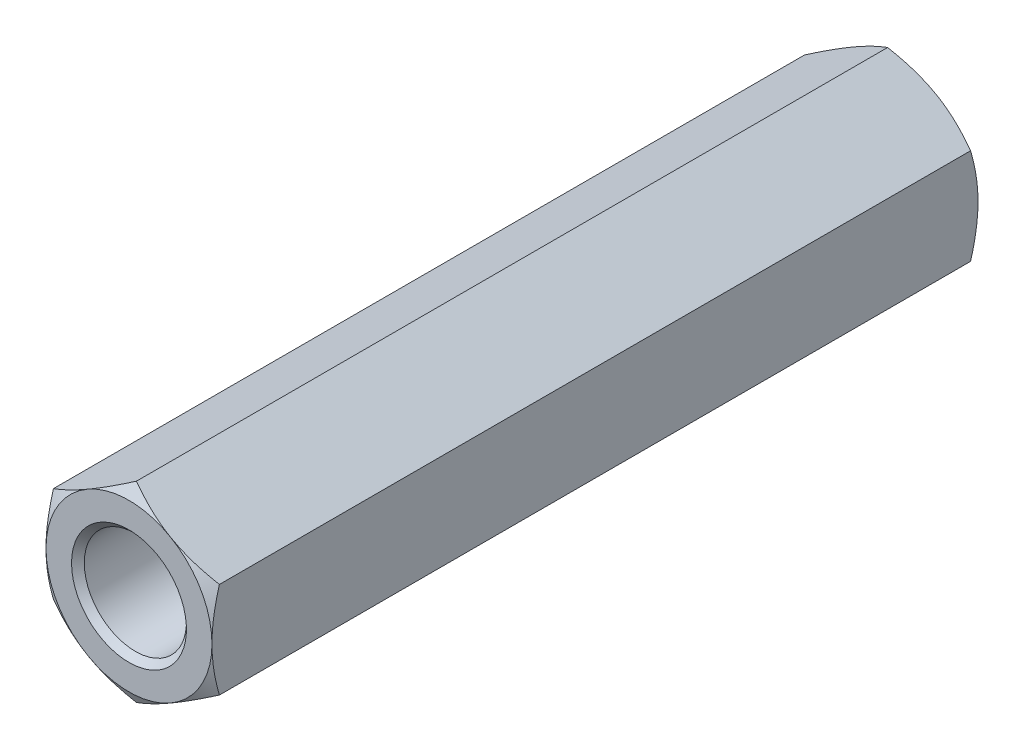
ISO-10303-21;
HEADER;
FILE_DESCRIPTION(('STEP AP214'),'2;1');
FILE_NAME('part.step','',(''),(''),'','','');
FILE_SCHEMA(('AUTOMOTIVE_DESIGN { 1 0 10303 214 1 1 1 1 }'));
ENDSEC;
DATA;
#1=APPLICATION_CONTEXT('core data for automotive mechanical design processes');
#2=APPLICATION_PROTOCOL_DEFINITION('international standard','automotive_design',2000,#1);
#3=PRODUCT_CONTEXT('',#1,'mechanical');
#4=PRODUCT('Part','Part','',(#3));
#5=PRODUCT_RELATED_PRODUCT_CATEGORY('part','',(#4));
#6=PRODUCT_DEFINITION_FORMATION('','',#4);
#7=PRODUCT_DEFINITION_CONTEXT('part definition',#1,'design');
#8=PRODUCT_DEFINITION('design','',#6,#7);
#9=PRODUCT_DEFINITION_SHAPE('','',#8);
#10=(LENGTH_UNIT() NAMED_UNIT(*) SI_UNIT(.MILLI.,.METRE.));
#11=(NAMED_UNIT(*) PLANE_ANGLE_UNIT() SI_UNIT($,.RADIAN.));
#12=(NAMED_UNIT(*) SI_UNIT($,.STERADIAN.) SOLID_ANGLE_UNIT());
#13=UNCERTAINTY_MEASURE_WITH_UNIT(LENGTH_MEASURE(1.E-05),#10,'distance_accuracy_value','');
#14=(GEOMETRIC_REPRESENTATION_CONTEXT(3) GLOBAL_UNCERTAINTY_ASSIGNED_CONTEXT((#13)) GLOBAL_UNIT_ASSIGNED_CONTEXT((#10,
#11,#12)) REPRESENTATION_CONTEXT('',''));
#15=CARTESIAN_POINT('',(0.,0.,0.));
#16=DIRECTION('',(0.,0.,1.));
#17=DIRECTION('',(1.,0.,0.));
#18=AXIS2_PLACEMENT_3D('',#15,#16,#17);
#19=CARTESIAN_POINT('',(6.5,3.75277674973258,60.));
#20=DIRECTION('',(-0.5,-0.866025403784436,0.));
#21=DIRECTION('',(-0.866025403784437,0.5,0.));
#22=AXIS2_PLACEMENT_3D('',#19,#20,#21);
#23=PLANE('',#22);
#24=CARTESIAN_POINT('',(-0.00019999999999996,7.50566896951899,0.580623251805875));
#25=CARTESIAN_POINT('',(0.14267745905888,7.42317863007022,0.533004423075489));
#26=CARTESIAN_POINT('',(0.286087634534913,7.3403807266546,0.487546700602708));
#27=CARTESIAN_POINT('',(0.574072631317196,7.17411251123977,0.401548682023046));
#28=CARTESIAN_POINT('',(0.718647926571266,7.09064192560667,0.361010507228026));
#29=CARTESIAN_POINT('',(1.15468865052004,6.8388936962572,0.247571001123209));
#30=CARTESIAN_POINT('',(1.44787528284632,6.66962231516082,0.183047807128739));
#31=CARTESIAN_POINT('',(1.88662374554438,6.41631077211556,0.10738658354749));
#32=CARTESIAN_POINT('',(2.03087463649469,6.33302748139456,0.0858328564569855));
#33=CARTESIAN_POINT('',(2.32002821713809,6.16608458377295,0.049690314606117));
#34=CARTESIAN_POINT('',(2.46493084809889,6.08242501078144,0.035100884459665));
#35=CARTESIAN_POINT('',(2.75498777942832,5.91496056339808,0.0132587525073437));
#36=CARTESIAN_POINT('',(2.90014160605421,5.83115596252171,0.00599772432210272));
#37=CARTESIAN_POINT('',(3.19057533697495,5.66347396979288,-0.00103969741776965));
#38=CARTESIAN_POINT('',(3.33585523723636,5.57959658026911,-0.000816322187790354));
#39=CARTESIAN_POINT('',(3.7338759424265,5.34979921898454,0.010083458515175));
#40=CARTESIAN_POINT('',(3.98648646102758,5.20395446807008,0.028381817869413));
#41=CARTESIAN_POINT('',(4.49002967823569,4.91323365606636,0.0864063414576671));
#42=CARTESIAN_POINT('',(4.74096060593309,4.76835861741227,0.126152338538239));
#43=CARTESIAN_POINT('',(5.24551722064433,4.47705272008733,0.225505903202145));
#44=CARTESIAN_POINT('',(5.49907924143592,4.33065861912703,0.285534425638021));
#45=CARTESIAN_POINT('',(6.00242193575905,4.04005357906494,0.421774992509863));
#46=CARTESIAN_POINT('',(6.25220905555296,3.89583891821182,0.497955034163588));
#47=CARTESIAN_POINT('',(6.5002,3.75266127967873,0.580623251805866));
#48=B_SPLINE_CURVE_WITH_KNOTS('',3,(#24,#25,#26,#27,#28,#29,#30,#31,#32,#33,#34,#35,#36,#37,#38,
#39,#40,#41,#42,#43,#44,#45,#46,#47),.UNSPECIFIED.,.F.,.F.,(4,2,2,2,2,2,2,2,2,2,2,4),(0.,
0.515105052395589,1.03043143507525,2.06322554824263,2.56697389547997,3.07067772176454,
3.57380860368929,4.07692394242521,4.95279354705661,5.82947446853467,6.72559912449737,
7.61996451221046),.UNSPECIFIED.);
#49=CARTESIAN_POINT('',(0.,7.50555349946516,0.580556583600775));
#50=VERTEX_POINT('',#49);
#51=CARTESIAN_POINT('',(3.25,5.62916512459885,0.));
#52=VERTEX_POINT('',#51);
#53=EDGE_CURVE('E330',#50,#52,#48,.T.);
#54=ORIENTED_EDGE('',*,*,#53,.F.);
#55=DIRECTION('',(0.,0.,-1.));
#56=VECTOR('',#55,1.);
#57=CARTESIAN_POINT('',(0.,7.50555349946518,60.));
#58=LINE('',#57,#56);
#59=CARTESIAN_POINT('',(0.,7.50555349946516,59.4194434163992));
#60=VERTEX_POINT('',#59);
#61=EDGE_CURVE('E239',#60,#50,#58,.T.);
#62=ORIENTED_EDGE('',*,*,#61,.F.);
#63=CARTESIAN_POINT('',(6.5002,3.75266127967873,59.4193767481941));
#64=CARTESIAN_POINT('',(6.35732254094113,3.83515161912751,59.4669955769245));
#65=CARTESIAN_POINT('',(6.2139123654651,3.91794952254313,59.5124532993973));
#66=CARTESIAN_POINT('',(5.92592736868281,4.08421773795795,59.598451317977));
#67=CARTESIAN_POINT('',(5.78135207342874,4.16768832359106,59.638989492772));
#68=CARTESIAN_POINT('',(5.34531134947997,4.41943655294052,59.7524289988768));
#69=CARTESIAN_POINT('',(5.05212471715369,4.5887079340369,59.8169521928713));
#70=CARTESIAN_POINT('',(4.61337625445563,4.84201947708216,59.8926134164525));
#71=CARTESIAN_POINT('',(4.46912536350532,4.92530276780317,59.914167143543));
#72=CARTESIAN_POINT('',(4.17997178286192,5.09224566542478,59.9503096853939));
#73=CARTESIAN_POINT('',(4.03506915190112,5.17590523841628,59.9648991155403));
#74=CARTESIAN_POINT('',(3.74501222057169,5.34336968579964,59.9867412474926));
#75=CARTESIAN_POINT('',(3.5998583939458,5.42717428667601,59.9940022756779));
#76=CARTESIAN_POINT('',(3.30942466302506,5.59485627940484,60.0010396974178));
#77=CARTESIAN_POINT('',(3.16414476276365,5.67873366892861,60.0008163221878));
#78=CARTESIAN_POINT('',(2.76612405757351,5.90853103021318,59.9899165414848));
#79=CARTESIAN_POINT('',(2.51351353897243,6.05437578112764,59.9716181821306));
#80=CARTESIAN_POINT('',(2.00997032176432,6.34509659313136,59.9135936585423));
#81=CARTESIAN_POINT('',(1.75903939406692,6.48997163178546,59.8738476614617));
#82=CARTESIAN_POINT('',(1.25448277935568,6.7812775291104,59.7744940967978));
#83=CARTESIAN_POINT('',(1.00092075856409,6.92767163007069,59.714465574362));
#84=CARTESIAN_POINT('',(0.497578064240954,7.21827667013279,59.5782250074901));
#85=CARTESIAN_POINT('',(0.247790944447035,7.36249133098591,59.5020449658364));
#86=CARTESIAN_POINT('',(-0.000200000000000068,7.50566896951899,59.4193767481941));
#87=B_SPLINE_CURVE_WITH_KNOTS('',3,(#63,#64,#65,#66,#67,#68,#69,#70,#71,#72,#73,#74,#75,#76,#77,
#78,#79,#80,#81,#82,#83,#84,#85,#86),.UNSPECIFIED.,.F.,.F.,(4,2,2,2,2,2,2,2,2,2,2,4),(0.,
0.515105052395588,1.03043143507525,2.06322554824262,2.56697389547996,3.07067772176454,
3.57380860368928,4.0769239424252,4.95279354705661,5.82947446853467,6.72559912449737,
7.61996451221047),.UNSPECIFIED.);
#88=CARTESIAN_POINT('',(3.25,5.62916512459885,60.));
#89=VERTEX_POINT('',#88);
#90=EDGE_CURVE('E225',#89,#60,#87,.T.);
#91=ORIENTED_EDGE('',*,*,#90,.F.);
#92=CARTESIAN_POINT('',(6.5,3.75277674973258,59.4194434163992));
#93=VERTEX_POINT('',#92);
#94=EDGE_CURVE('E301',#93,#89,#87,.T.);
#95=ORIENTED_EDGE('',*,*,#94,.F.);
#96=DIRECTION('',(0.,0.,-1.));
#97=VECTOR('',#96,1.);
#98=CARTESIAN_POINT('',(6.5,3.75277674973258,60.));
#99=LINE('',#98,#97);
#100=CARTESIAN_POINT('',(6.5,3.75277674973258,0.580556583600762));
#101=VERTEX_POINT('',#100);
#102=EDGE_CURVE('E227',#93,#101,#99,.T.);
#103=ORIENTED_EDGE('',*,*,#102,.T.);
#104=EDGE_CURVE('E37',#52,#101,#48,.T.);
#105=ORIENTED_EDGE('',*,*,#104,.F.);
#106=EDGE_LOOP('',(#54,#62,#91,#95,#103,#105));
#107=FACE_BOUND('',#106,.T.);
#108=ADVANCED_FACE('F14',(#107),#23,.F.);
#109=CARTESIAN_POINT('',(-6.5,3.75277674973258,60.));
#110=DIRECTION('',(-0.5,0.866025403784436,0.));
#111=DIRECTION('',(0.866025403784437,0.5,0.));
#112=AXIS2_PLACEMENT_3D('',#109,#110,#111);
#113=PLANE('',#112);
#114=ORIENTED_EDGE('',*,*,#61,.T.);
#115=CARTESIAN_POINT('',(0.000200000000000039,7.50566896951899,0.580623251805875));
#116=CARTESIAN_POINT('',(-0.14267745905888,7.42317863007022,0.533004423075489));
#117=CARTESIAN_POINT('',(-0.286087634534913,7.3403807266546,0.487546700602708));
#118=CARTESIAN_POINT('',(-0.574072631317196,7.17411251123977,0.401548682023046));
#119=CARTESIAN_POINT('',(-0.718647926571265,7.09064192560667,0.361010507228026));
#120=CARTESIAN_POINT('',(-1.15468865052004,6.8388936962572,0.247571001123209));
#121=CARTESIAN_POINT('',(-1.44787528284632,6.66962231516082,0.183047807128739));
#122=CARTESIAN_POINT('',(-1.88662374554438,6.41631077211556,0.10738658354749));
#123=CARTESIAN_POINT('',(-2.03087463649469,6.33302748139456,0.0858328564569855));
#124=CARTESIAN_POINT('',(-2.32002821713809,6.16608458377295,0.049690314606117));
#125=CARTESIAN_POINT('',(-2.46493084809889,6.08242501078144,0.035100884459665));
#126=CARTESIAN_POINT('',(-2.75498777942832,5.91496056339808,0.0132587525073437));
#127=CARTESIAN_POINT('',(-2.90014160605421,5.83115596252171,0.00599772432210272));
#128=CARTESIAN_POINT('',(-3.19057533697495,5.66347396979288,-0.00103969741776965));
#129=CARTESIAN_POINT('',(-3.33585523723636,5.57959658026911,-0.000816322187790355));
#130=CARTESIAN_POINT('',(-3.7338759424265,5.34979921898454,0.010083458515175));
#131=CARTESIAN_POINT('',(-3.98648646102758,5.20395446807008,0.028381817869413));
#132=CARTESIAN_POINT('',(-4.49002967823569,4.91323365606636,0.0864063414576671));
#133=CARTESIAN_POINT('',(-4.74096060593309,4.76835861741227,0.126152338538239));
#134=CARTESIAN_POINT('',(-5.24551722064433,4.47705272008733,0.225505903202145));
#135=CARTESIAN_POINT('',(-5.49907924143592,4.33065861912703,0.285534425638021));
#136=CARTESIAN_POINT('',(-6.00242193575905,4.04005357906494,0.421774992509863));
#137=CARTESIAN_POINT('',(-6.25220905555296,3.89583891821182,0.497955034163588));
#138=CARTESIAN_POINT('',(-6.5002,3.75266127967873,0.580623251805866));
#139=B_SPLINE_CURVE_WITH_KNOTS('',3,(#115,#116,#117,#118,#119,#120,#121,#122,#123,#124,#125,
#126,#127,#128,#129,#130,#131,#132,#133,#134,#135,#136,#137,#138),.UNSPECIFIED.,.F.,.F.,(4,2,2,
2,2,2,2,2,2,2,2,4),(0.,0.515105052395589,1.03043143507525,2.06322554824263,2.56697389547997,
3.07067772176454,3.57380860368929,4.07692394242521,4.95279354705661,5.82947446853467,
6.72559912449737,7.61996451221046),.UNSPECIFIED.);
#140=CARTESIAN_POINT('',(-3.25,5.62916512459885,0.));
#141=VERTEX_POINT('',#140);
#142=EDGE_CURVE('E184',#50,#141,#139,.T.);
#143=ORIENTED_EDGE('',*,*,#142,.T.);
#144=CARTESIAN_POINT('',(-6.5,3.75277674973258,0.580556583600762));
#145=VERTEX_POINT('',#144);
#146=EDGE_CURVE('E319',#141,#145,#139,.T.);
#147=ORIENTED_EDGE('',*,*,#146,.T.);
#148=DIRECTION('',(0.,0.,-1.));
#149=VECTOR('',#148,1.);
#150=CARTESIAN_POINT('',(-6.5,3.75277674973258,60.));
#151=LINE('',#150,#149);
#152=CARTESIAN_POINT('',(-6.5,3.75277674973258,59.4194434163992));
#153=VERTEX_POINT('',#152);
#154=EDGE_CURVE('E236',#153,#145,#151,.T.);
#155=ORIENTED_EDGE('',*,*,#154,.F.);
#156=CARTESIAN_POINT('',(-6.5002,3.75266127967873,59.4193767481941));
#157=CARTESIAN_POINT('',(-6.35732254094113,3.83515161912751,59.4669955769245));
#158=CARTESIAN_POINT('',(-6.2139123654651,3.91794952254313,59.5124532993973));
#159=CARTESIAN_POINT('',(-5.92592736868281,4.08421773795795,59.598451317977));
#160=CARTESIAN_POINT('',(-5.78135207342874,4.16768832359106,59.638989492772));
#161=CARTESIAN_POINT('',(-5.34531134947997,4.41943655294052,59.7524289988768));
#162=CARTESIAN_POINT('',(-5.05212471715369,4.5887079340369,59.8169521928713));
#163=CARTESIAN_POINT('',(-4.61337625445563,4.84201947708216,59.8926134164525));
#164=CARTESIAN_POINT('',(-4.46912536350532,4.92530276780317,59.914167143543));
#165=CARTESIAN_POINT('',(-4.17997178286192,5.09224566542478,59.9503096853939));
#166=CARTESIAN_POINT('',(-4.03506915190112,5.17590523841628,59.9648991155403));
#167=CARTESIAN_POINT('',(-3.74501222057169,5.34336968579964,59.9867412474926));
#168=CARTESIAN_POINT('',(-3.5998583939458,5.42717428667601,59.9940022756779));
#169=CARTESIAN_POINT('',(-3.30942466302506,5.59485627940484,60.0010396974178));
#170=CARTESIAN_POINT('',(-3.16414476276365,5.67873366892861,60.0008163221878));
#171=CARTESIAN_POINT('',(-2.76612405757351,5.90853103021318,59.9899165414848));
#172=CARTESIAN_POINT('',(-2.51351353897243,6.05437578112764,59.9716181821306));
#173=CARTESIAN_POINT('',(-2.00997032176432,6.34509659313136,59.9135936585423));
#174=CARTESIAN_POINT('',(-1.75903939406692,6.48997163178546,59.8738476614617));
#175=CARTESIAN_POINT('',(-1.25448277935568,6.7812775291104,59.7744940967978));
#176=CARTESIAN_POINT('',(-1.00092075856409,6.92767163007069,59.714465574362));
#177=CARTESIAN_POINT('',(-0.497578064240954,7.21827667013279,59.5782250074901));
#178=CARTESIAN_POINT('',(-0.247790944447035,7.36249133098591,59.5020449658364));
#179=CARTESIAN_POINT('',(0.000200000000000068,7.50566896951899,59.4193767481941));
#180=B_SPLINE_CURVE_WITH_KNOTS('',3,(#156,#157,#158,#159,#160,#161,#162,#163,#164,#165,#166,
#167,#168,#169,#170,#171,#172,#173,#174,#175,#176,#177,#178,#179),.UNSPECIFIED.,.F.,.F.,(4,2,2,
2,2,2,2,2,2,2,2,4),(0.,0.515105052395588,1.03043143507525,2.06322554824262,2.56697389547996,
3.07067772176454,3.57380860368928,4.0769239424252,4.95279354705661,5.82947446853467,
6.72559912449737,7.61996451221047),.UNSPECIFIED.);
#181=CARTESIAN_POINT('',(-3.25,5.62916512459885,60.));
#182=VERTEX_POINT('',#181);
#183=EDGE_CURVE('E218',#153,#182,#180,.T.);
#184=ORIENTED_EDGE('',*,*,#183,.T.);
#185=EDGE_CURVE('E226',#182,#60,#180,.T.);
#186=ORIENTED_EDGE('',*,*,#185,.T.);
#187=EDGE_LOOP('',(#114,#143,#147,#155,#184,#186));
#188=FACE_BOUND('',#187,.T.);
#189=ADVANCED_FACE('F197',(#188),#113,.T.);
#190=CARTESIAN_POINT('',(-6.5,3.75277674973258,60.));
#191=DIRECTION('',(1.,0.,0.));
#192=DIRECTION('',(0.,0.,-1.));
#193=AXIS2_PLACEMENT_3D('',#190,#191,#192);
#194=PLANE('',#193);
#195=CARTESIAN_POINT('',(-6.5,-10.0834180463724,3.17362971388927));
#196=CARTESIAN_POINT('',(-6.5,-9.79950109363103,3.03589247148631));
#197=CARTESIAN_POINT('',(-6.5,-9.51493272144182,2.89947501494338));
#198=CARTESIAN_POINT('',(-6.5,-8.94414675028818,2.63002186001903));
#199=CARTESIAN_POINT('',(-6.5,-8.65792890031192,2.49698669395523));
#200=CARTESIAN_POINT('',(-6.5,-8.08202429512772,2.23437163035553));
#201=CARTESIAN_POINT('',(-6.5,-7.79232713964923,2.10481446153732));
#202=CARTESIAN_POINT('',(-6.5,-7.21062978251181,1.85099781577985));
#203=CARTESIAN_POINT('',(-6.5,-6.91862969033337,1.7267380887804));
#204=CARTESIAN_POINT('',(-6.5,-6.32241274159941,1.48102036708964));
#205=CARTESIAN_POINT('',(-6.5,-6.01810517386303,1.35978128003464));
#206=CARTESIAN_POINT('',(-6.5,-5.40593060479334,1.12647175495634));
#207=CARTESIAN_POINT('',(-6.5,-5.09806320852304,1.01440234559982));
#208=CARTESIAN_POINT('',(-6.5,-4.47885570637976,0.802371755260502));
#209=CARTESIAN_POINT('',(-6.5,-4.16752406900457,0.702386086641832));
#210=CARTESIAN_POINT('',(-6.5,-3.54039144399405,0.51773061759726));
#211=CARTESIAN_POINT('',(-6.5,-3.22459189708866,0.433055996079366));
#212=CARTESIAN_POINT('',(-6.5,-2.5901204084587,0.28353288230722));
#213=CARTESIAN_POINT('',(-6.5,-2.27147433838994,0.218576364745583));
#214=CARTESIAN_POINT('',(-6.5,-1.63017111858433,0.112171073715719));
#215=CARTESIAN_POINT('',(-6.5,-1.30751435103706,0.0707200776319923));
#216=CARTESIAN_POINT('',(-6.5,-0.8239501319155,0.0289247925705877));
#217=CARTESIAN_POINT('',(-6.5,-0.663883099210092,0.0183938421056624));
#218=CARTESIAN_POINT('',(-6.5,-0.343440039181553,0.00410463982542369));
#219=CARTESIAN_POINT('',(-6.5,-0.183064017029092,0.00034627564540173));
#220=CARTESIAN_POINT('',(-6.5,0.137701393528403,-0.000300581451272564));
#221=CARTESIAN_POINT('',(-6.5,0.298090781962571,0.00281094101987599));
#222=CARTESIAN_POINT('',(-6.5,0.618596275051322,0.0158257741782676));
#223=CARTESIAN_POINT('',(-6.5,0.778712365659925,0.0257294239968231));
#224=CARTESIAN_POINT('',(-6.5,1.16343750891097,0.0574770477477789));
#225=CARTESIAN_POINT('',(-6.5,1.38778653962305,0.0825393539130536));
#226=CARTESIAN_POINT('',(-6.5,1.83481089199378,0.144632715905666));
#227=CARTESIAN_POINT('',(-6.5,2.05748598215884,0.181665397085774));
#228=CARTESIAN_POINT('',(-6.5,2.72275129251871,0.308754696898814));
#229=CARTESIAN_POINT('',(-6.5,3.16233095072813,0.414779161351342));
#230=CARTESIAN_POINT('',(-6.5,3.81960213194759,0.59852550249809));
#231=CARTESIAN_POINT('',(-6.5,4.04070596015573,0.664742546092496));
#232=CARTESIAN_POINT('',(-6.5,4.48076604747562,0.804028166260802));
#233=CARTESIAN_POINT('',(-6.5,4.69972229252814,0.877096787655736));
#234=CARTESIAN_POINT('',(-6.5,5.13555635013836,1.02891539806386));
#235=CARTESIAN_POINT('',(-6.5,5.35243482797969,1.10766349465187));
#236=CARTESIAN_POINT('',(-6.5,5.78439688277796,1.26991713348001));
#237=CARTESIAN_POINT('',(-6.5,5.99948047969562,1.3534226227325));
#238=CARTESIAN_POINT('',(-6.5,6.5026034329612,1.55414329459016));
#239=CARTESIAN_POINT('',(-6.5,6.78999463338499,1.67298001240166));
#240=CARTESIAN_POINT('',(-6.5,7.36236269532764,1.91634846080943));
#241=CARTESIAN_POINT('',(-6.5,7.64733941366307,2.04088052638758));
#242=CARTESIAN_POINT('',(-6.5,8.2153158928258,2.29450953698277));
#243=CARTESIAN_POINT('',(-6.5,8.4983152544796,2.42360737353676));
#244=CARTESIAN_POINT('',(-6.5,9.06261769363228,2.68546510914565));
#245=CARTESIAN_POINT('',(-6.5,9.34392073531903,2.81822508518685));
#246=CARTESIAN_POINT('',(-6.5,9.90539299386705,3.08686493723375));
#247=CARTESIAN_POINT('',(-6.5,10.1855607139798,3.22274793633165));
#248=CARTESIAN_POINT('',(-6.5,10.7446905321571,3.49697439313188));
#249=CARTESIAN_POINT('',(-6.5,11.0236526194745,3.63531787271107));
#250=CARTESIAN_POINT('',(-6.5,11.8589430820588,4.05335507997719));
#251=CARTESIAN_POINT('',(-6.5,12.4137488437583,4.3360908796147));
#252=CARTESIAN_POINT('',(-6.5,13.4746565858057,4.88367632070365));
#253=CARTESIAN_POINT('',(-6.5,13.9809936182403,5.14807259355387));
#254=CARTESIAN_POINT('',(-6.5,14.991771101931,5.68050506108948));
#255=CARTESIAN_POINT('',(-6.5,15.4962114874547,5.94854138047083));
#256=CARTESIAN_POINT('',(-6.5,16.5023728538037,6.48672924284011));
#257=CARTESIAN_POINT('',(-6.5,17.0040974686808,6.75687400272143));
#258=CARTESIAN_POINT('',(-6.5,18.0063312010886,7.29934511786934));
#259=CARTESIAN_POINT('',(-6.5,18.5068403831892,7.57167135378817));
#260=CARTESIAN_POINT('',(-6.5,19.0069009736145,7.84481329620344));
#261=B_SPLINE_CURVE_WITH_KNOTS('',3,(#195,#196,#197,#198,#199,#200,#201,#202,#203,#204,#205,
#206,#207,#208,#209,#210,#211,#212,#213,#214,#215,#216,#217,#218,#219,#220,#221,#222,#223,#224,
#225,#226,#227,#228,#229,#230,#231,#232,#233,#234,#235,#236,#237,#238,#239,#240,#241,#242,#243,
#244,#245,#246,#247,#248,#249,#250,#251,#252,#253,#254,#255,#256,#257,#258,#259,#260),
.UNSPECIFIED.,.F.,.F.,(4,2,2,2,2,2,2,2,2,2,2,2,2,2,2,2,2,2,2,2,2,2,2,2,2,2,2,2,2,2,2,2,4),(0.,
0.946702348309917,1.89355278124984,2.84555312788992,3.7975084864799,4.78010397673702,
5.7628095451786,6.74348903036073,7.72385918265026,8.69875720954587,9.67356303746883,
10.1546807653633,10.6357905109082,11.1169013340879,11.5980361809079,12.2748875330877,
12.9518308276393,14.3064691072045,14.9988308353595,15.69119709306,16.3833337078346,
17.0754626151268,18.008355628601,18.941303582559,19.8744347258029,20.807585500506,
21.7417139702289,22.675850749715,24.5438805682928,26.2574992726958,27.9711768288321,
29.6806599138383,31.3900501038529),.UNSPECIFIED.);
#262=CARTESIAN_POINT('',(-6.5,-3.75277674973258,0.580556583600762));
#263=VERTEX_POINT('',#262);
#264=CARTESIAN_POINT('',(-6.5,0.,0.));
#265=VERTEX_POINT('',#264);
#266=EDGE_CURVE('E178',#263,#265,#261,.T.);
#267=ORIENTED_EDGE('',*,*,#266,.F.);
#268=DIRECTION('',(0.,0.,-1.));
#269=VECTOR('',#268,1.);
#270=CARTESIAN_POINT('',(-6.5,-3.75277674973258,60.));
#271=LINE('',#270,#269);
#272=CARTESIAN_POINT('',(-6.5,-3.75277674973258,59.4194434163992));
#273=VERTEX_POINT('',#272);
#274=EDGE_CURVE('E233',#273,#263,#271,.T.);
#275=ORIENTED_EDGE('',*,*,#274,.F.);
#276=CARTESIAN_POINT('',(-6.5,-10.0834180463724,56.8263702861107));
#277=CARTESIAN_POINT('',(-6.5,-9.79950109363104,56.9641075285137));
#278=CARTESIAN_POINT('',(-6.5,-9.51493272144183,57.1005249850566));
#279=CARTESIAN_POINT('',(-6.5,-8.9441467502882,57.369978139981));
#280=CARTESIAN_POINT('',(-6.5,-8.65792890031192,57.5030133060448));
#281=CARTESIAN_POINT('',(-6.5,-8.08202429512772,57.7656283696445));
#282=CARTESIAN_POINT('',(-6.5,-7.79232713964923,57.8951855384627));
#283=CARTESIAN_POINT('',(-6.5,-7.21062978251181,58.1490021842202));
#284=CARTESIAN_POINT('',(-6.5,-6.91862969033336,58.2732619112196));
#285=CARTESIAN_POINT('',(-6.5,-6.3224127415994,58.5189796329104));
#286=CARTESIAN_POINT('',(-6.5,-6.01810517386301,58.6402187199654));
#287=CARTESIAN_POINT('',(-6.5,-5.40593060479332,58.8735282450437));
#288=CARTESIAN_POINT('',(-6.5,-5.09806320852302,58.9855976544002));
#289=CARTESIAN_POINT('',(-6.5,-4.47885570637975,59.1976282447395));
#290=CARTESIAN_POINT('',(-6.5,-4.16752406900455,59.2976139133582));
#291=CARTESIAN_POINT('',(-6.5,-3.54039144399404,59.4822693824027));
#292=CARTESIAN_POINT('',(-6.5,-3.22459189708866,59.5669440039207));
#293=CARTESIAN_POINT('',(-6.5,-2.5901204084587,59.7164671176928));
#294=CARTESIAN_POINT('',(-6.5,-2.27147433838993,59.7814236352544));
#295=CARTESIAN_POINT('',(-6.5,-1.63017111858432,59.8878289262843));
#296=CARTESIAN_POINT('',(-6.5,-1.30751435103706,59.929279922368));
#297=CARTESIAN_POINT('',(-6.5,-0.823950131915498,59.9710752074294));
#298=CARTESIAN_POINT('',(-6.5,-0.663883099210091,59.9816061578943));
#299=CARTESIAN_POINT('',(-6.5,-0.343440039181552,59.9958953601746));
#300=CARTESIAN_POINT('',(-6.5,-0.183064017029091,59.9996537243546));
#301=CARTESIAN_POINT('',(-6.5,0.137701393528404,60.0003005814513));
#302=CARTESIAN_POINT('',(-6.5,0.298090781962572,59.9971890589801));
#303=CARTESIAN_POINT('',(-6.5,0.618596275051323,59.9841742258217));
#304=CARTESIAN_POINT('',(-6.5,0.778712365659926,59.9742705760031));
#305=CARTESIAN_POINT('',(-6.5,1.16343750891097,59.9425229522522));
#306=CARTESIAN_POINT('',(-6.5,1.38778653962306,59.9174606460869));
#307=CARTESIAN_POINT('',(-6.5,1.83481089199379,59.8553672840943));
#308=CARTESIAN_POINT('',(-6.5,2.05748598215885,59.8183346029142));
#309=CARTESIAN_POINT('',(-6.5,2.72275129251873,59.6912453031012));
#310=CARTESIAN_POINT('',(-6.5,3.16233095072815,59.5852208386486));
#311=CARTESIAN_POINT('',(-6.5,3.81960213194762,59.4014744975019));
#312=CARTESIAN_POINT('',(-6.5,4.04070596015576,59.3352574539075));
#313=CARTESIAN_POINT('',(-6.5,4.48076604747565,59.1959718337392));
#314=CARTESIAN_POINT('',(-6.5,4.69972229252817,59.1229032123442));
#315=CARTESIAN_POINT('',(-6.5,5.13555635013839,58.9710846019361));
#316=CARTESIAN_POINT('',(-6.5,5.35243482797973,58.8923365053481));
#317=CARTESIAN_POINT('',(-6.5,5.78439688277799,58.73008286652));
#318=CARTESIAN_POINT('',(-6.5,5.99948047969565,58.6465773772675));
#319=CARTESIAN_POINT('',(-6.5,6.50260343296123,58.4458567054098));
#320=CARTESIAN_POINT('',(-6.5,6.78999463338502,58.3270199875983));
#321=CARTESIAN_POINT('',(-6.5,7.36236269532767,58.0836515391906));
#322=CARTESIAN_POINT('',(-6.5,7.6473394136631,57.9591194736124));
#323=CARTESIAN_POINT('',(-6.5,8.21531589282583,57.7054904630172));
#324=CARTESIAN_POINT('',(-6.5,8.49831525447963,57.5763926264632));
#325=CARTESIAN_POINT('',(-6.5,9.0626176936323,57.3145348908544));
#326=CARTESIAN_POINT('',(-6.5,9.34392073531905,57.1817749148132));
#327=CARTESIAN_POINT('',(-6.5,9.90539299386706,56.9131350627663));
#328=CARTESIAN_POINT('',(-6.5,10.1855607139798,56.7772520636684));
#329=CARTESIAN_POINT('',(-6.5,10.7446905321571,56.5030256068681));
#330=CARTESIAN_POINT('',(-6.5,11.0236526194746,56.364682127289));
#331=CARTESIAN_POINT('',(-6.5,11.8589430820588,55.9466449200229));
#332=CARTESIAN_POINT('',(-6.5,12.4137488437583,55.6639091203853));
#333=CARTESIAN_POINT('',(-6.5,13.4746565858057,55.1163236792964));
#334=CARTESIAN_POINT('',(-6.5,13.9809936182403,54.8519274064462));
#335=CARTESIAN_POINT('',(-6.5,14.991771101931,54.3194949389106));
#336=CARTESIAN_POINT('',(-6.5,15.4962114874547,54.0514586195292));
#337=CARTESIAN_POINT('',(-6.5,16.5023728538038,53.51327075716));
#338=CARTESIAN_POINT('',(-6.5,17.0040974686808,53.2431259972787));
#339=CARTESIAN_POINT('',(-6.5,18.0063312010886,52.7006548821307));
#340=CARTESIAN_POINT('',(-6.5,18.5068403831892,52.4283286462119));
#341=CARTESIAN_POINT('',(-6.5,19.0069009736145,52.1551867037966));
#342=B_SPLINE_CURVE_WITH_KNOTS('',3,(#276,#277,#278,#279,#280,#281,#282,#283,#284,#285,#286,
#287,#288,#289,#290,#291,#292,#293,#294,#295,#296,#297,#298,#299,#300,#301,#302,#303,#304,#305,
#306,#307,#308,#309,#310,#311,#312,#313,#314,#315,#316,#317,#318,#319,#320,#321,#322,#323,#324,
#325,#326,#327,#328,#329,#330,#331,#332,#333,#334,#335,#336,#337,#338,#339,#340,#341),
.UNSPECIFIED.,.F.,.F.,(4,2,2,2,2,2,2,2,2,2,2,2,2,2,2,2,2,2,2,2,2,2,2,2,2,2,2,2,2,2,2,2,4),(0.,
0.946702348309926,1.89355278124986,2.84555312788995,3.79750848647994,4.78010397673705,
5.76280954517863,6.74348903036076,7.72385918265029,8.69875720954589,9.67356303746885,
10.1546807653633,10.6357905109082,11.1169013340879,11.5980361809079,12.2748875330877,
12.9518308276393,14.3064691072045,14.9988308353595,15.6911970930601,16.3833337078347,
17.0754626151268,18.008355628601,18.9413035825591,19.8744347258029,20.807585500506,
21.7417139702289,22.675850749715,24.5438805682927,26.2574992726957,27.9711768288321,
29.6806599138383,31.3900501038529),.UNSPECIFIED.);
#343=CARTESIAN_POINT('',(-6.5,0.,60.));
#344=VERTEX_POINT('',#343);
#345=EDGE_CURVE('E203',#344,#273,#342,.F.);
#346=ORIENTED_EDGE('',*,*,#345,.F.);
#347=EDGE_CURVE('E210',#153,#344,#342,.F.);
#348=ORIENTED_EDGE('',*,*,#347,.F.);
#349=ORIENTED_EDGE('',*,*,#154,.T.);
#350=EDGE_CURVE('E186',#265,#145,#261,.T.);
#351=ORIENTED_EDGE('',*,*,#350,.F.);
#352=EDGE_LOOP('',(#267,#275,#346,#348,#349,#351));
#353=FACE_BOUND('',#352,.T.);
#354=ADVANCED_FACE('F193',(#353),#194,.F.);
#355=CARTESIAN_POINT('',(-6.5,-3.75277674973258,60.));
#356=DIRECTION('',(0.5,0.866025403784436,0.));
#357=DIRECTION('',(0.866025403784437,-0.5,0.));
#358=AXIS2_PLACEMENT_3D('',#355,#356,#357);
#359=PLANE('',#358);
#360=CARTESIAN_POINT('',(0.000200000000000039,-7.50566896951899,0.580623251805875));
#361=CARTESIAN_POINT('',(-0.14267745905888,-7.42317863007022,0.533004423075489));
#362=CARTESIAN_POINT('',(-0.286087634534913,-7.3403807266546,0.487546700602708));
#363=CARTESIAN_POINT('',(-0.574072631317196,-7.17411251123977,0.401548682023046));
#364=CARTESIAN_POINT('',(-0.718647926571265,-7.09064192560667,0.361010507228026));
#365=CARTESIAN_POINT('',(-1.15468865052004,-6.8388936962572,0.247571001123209));
#366=CARTESIAN_POINT('',(-1.44787528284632,-6.66962231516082,0.183047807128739));
#367=CARTESIAN_POINT('',(-1.88662374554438,-6.41631077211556,0.10738658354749));
#368=CARTESIAN_POINT('',(-2.03087463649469,-6.33302748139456,0.0858328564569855));
#369=CARTESIAN_POINT('',(-2.32002821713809,-6.16608458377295,0.049690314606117));
#370=CARTESIAN_POINT('',(-2.46493084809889,-6.08242501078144,0.035100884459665));
#371=CARTESIAN_POINT('',(-2.75498777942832,-5.91496056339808,0.0132587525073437));
#372=CARTESIAN_POINT('',(-2.90014160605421,-5.83115596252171,0.00599772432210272));
#373=CARTESIAN_POINT('',(-3.19057533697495,-5.66347396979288,-0.00103969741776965));
#374=CARTESIAN_POINT('',(-3.33585523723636,-5.57959658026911,-0.000816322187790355));
#375=CARTESIAN_POINT('',(-3.7338759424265,-5.34979921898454,0.010083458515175));
#376=CARTESIAN_POINT('',(-3.98648646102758,-5.20395446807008,0.028381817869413));
#377=CARTESIAN_POINT('',(-4.49002967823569,-4.91323365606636,0.0864063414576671));
#378=CARTESIAN_POINT('',(-4.74096060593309,-4.76835861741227,0.126152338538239));
#379=CARTESIAN_POINT('',(-5.24551722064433,-4.47705272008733,0.225505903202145));
#380=CARTESIAN_POINT('',(-5.49907924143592,-4.33065861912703,0.285534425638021));
#381=CARTESIAN_POINT('',(-6.00242193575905,-4.04005357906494,0.421774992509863));
#382=CARTESIAN_POINT('',(-6.25220905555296,-3.89583891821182,0.497955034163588));
#383=CARTESIAN_POINT('',(-6.5002,-3.75266127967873,0.580623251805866));
#384=B_SPLINE_CURVE_WITH_KNOTS('',3,(#360,#361,#362,#363,#364,#365,#366,#367,#368,#369,#370,
#371,#372,#373,#374,#375,#376,#377,#378,#379,#380,#381,#382,#383),.UNSPECIFIED.,.F.,.F.,(4,2,2,
2,2,2,2,2,2,2,2,4),(0.,0.515105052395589,1.03043143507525,2.06322554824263,2.56697389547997,
3.07067772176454,3.57380860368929,4.07692394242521,4.95279354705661,5.82947446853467,
6.72559912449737,7.61996451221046),.UNSPECIFIED.);
#385=CARTESIAN_POINT('',(0.,-7.50555349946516,0.580556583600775));
#386=VERTEX_POINT('',#385);
#387=CARTESIAN_POINT('',(-3.25,-5.62916512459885,0.));
#388=VERTEX_POINT('',#387);
#389=EDGE_CURVE('E166',#386,#388,#384,.T.);
#390=ORIENTED_EDGE('',*,*,#389,.F.);
#391=DIRECTION('',(0.,0.,-1.));
#392=VECTOR('',#391,1.);
#393=CARTESIAN_POINT('',(0.,-7.50555349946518,60.));
#394=LINE('',#393,#392);
#395=CARTESIAN_POINT('',(0.,-7.50555349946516,59.4194434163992));
#396=VERTEX_POINT('',#395);
#397=EDGE_CURVE('E230',#396,#386,#394,.T.);
#398=ORIENTED_EDGE('',*,*,#397,.F.);
#399=CARTESIAN_POINT('',(-6.5002,-3.75266127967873,59.4193767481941));
#400=CARTESIAN_POINT('',(-6.35732254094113,-3.83515161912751,59.4669955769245));
#401=CARTESIAN_POINT('',(-6.2139123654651,-3.91794952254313,59.5124532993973));
#402=CARTESIAN_POINT('',(-5.92592736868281,-4.08421773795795,59.598451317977));
#403=CARTESIAN_POINT('',(-5.78135207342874,-4.16768832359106,59.638989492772));
#404=CARTESIAN_POINT('',(-5.34531134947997,-4.41943655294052,59.7524289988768));
#405=CARTESIAN_POINT('',(-5.05212471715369,-4.5887079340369,59.8169521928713));
#406=CARTESIAN_POINT('',(-4.61337625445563,-4.84201947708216,59.8926134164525));
#407=CARTESIAN_POINT('',(-4.46912536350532,-4.92530276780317,59.914167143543));
#408=CARTESIAN_POINT('',(-4.17997178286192,-5.09224566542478,59.9503096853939));
#409=CARTESIAN_POINT('',(-4.03506915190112,-5.17590523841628,59.9648991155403));
#410=CARTESIAN_POINT('',(-3.74501222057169,-5.34336968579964,59.9867412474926));
#411=CARTESIAN_POINT('',(-3.5998583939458,-5.42717428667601,59.9940022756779));
#412=CARTESIAN_POINT('',(-3.30942466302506,-5.59485627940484,60.0010396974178));
#413=CARTESIAN_POINT('',(-3.16414476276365,-5.67873366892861,60.0008163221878));
#414=CARTESIAN_POINT('',(-2.76612405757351,-5.90853103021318,59.9899165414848));
#415=CARTESIAN_POINT('',(-2.51351353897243,-6.05437578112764,59.9716181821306));
#416=CARTESIAN_POINT('',(-2.00997032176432,-6.34509659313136,59.9135936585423));
#417=CARTESIAN_POINT('',(-1.75903939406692,-6.48997163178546,59.8738476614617));
#418=CARTESIAN_POINT('',(-1.25448277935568,-6.7812775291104,59.7744940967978));
#419=CARTESIAN_POINT('',(-1.00092075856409,-6.92767163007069,59.714465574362));
#420=CARTESIAN_POINT('',(-0.497578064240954,-7.21827667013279,59.5782250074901));
#421=CARTESIAN_POINT('',(-0.247790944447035,-7.36249133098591,59.5020449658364));
#422=CARTESIAN_POINT('',(0.000200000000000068,-7.50566896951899,59.4193767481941));
#423=B_SPLINE_CURVE_WITH_KNOTS('',3,(#399,#400,#401,#402,#403,#404,#405,#406,#407,#408,#409,
#410,#411,#412,#413,#414,#415,#416,#417,#418,#419,#420,#421,#422),.UNSPECIFIED.,.F.,.F.,(4,2,2,
2,2,2,2,2,2,2,2,4),(0.,0.515105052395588,1.03043143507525,2.06322554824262,2.56697389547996,
3.07067772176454,3.57380860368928,4.0769239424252,4.95279354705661,5.82947446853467,
6.72559912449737,7.61996451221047),.UNSPECIFIED.);
#424=CARTESIAN_POINT('',(-3.25,-5.62916512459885,60.));
#425=VERTEX_POINT('',#424);
#426=EDGE_CURVE('E212',#425,#396,#423,.T.);
#427=ORIENTED_EDGE('',*,*,#426,.F.);
#428=EDGE_CURVE('E211',#273,#425,#423,.T.);
#429=ORIENTED_EDGE('',*,*,#428,.F.);
#430=ORIENTED_EDGE('',*,*,#274,.T.);
#431=EDGE_CURVE('E185',#388,#263,#384,.T.);
#432=ORIENTED_EDGE('',*,*,#431,.F.);
#433=EDGE_LOOP('',(#390,#398,#427,#429,#430,#432));
#434=FACE_BOUND('',#433,.T.);
#435=ADVANCED_FACE('F196',(#434),#359,.F.);
#436=CARTESIAN_POINT('',(6.5,-3.75277674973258,60.));
#437=DIRECTION('',(0.5,-0.866025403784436,0.));
#438=DIRECTION('',(-0.866025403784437,-0.5,0.));
#439=AXIS2_PLACEMENT_3D('',#436,#437,#438);
#440=PLANE('',#439);
#441=ORIENTED_EDGE('',*,*,#397,.T.);
#442=CARTESIAN_POINT('',(-0.00019999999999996,-7.50566896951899,0.580623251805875));
#443=CARTESIAN_POINT('',(0.14267745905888,-7.42317863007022,0.533004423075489));
#444=CARTESIAN_POINT('',(0.286087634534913,-7.3403807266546,0.487546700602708));
#445=CARTESIAN_POINT('',(0.574072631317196,-7.17411251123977,0.401548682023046));
#446=CARTESIAN_POINT('',(0.718647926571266,-7.09064192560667,0.361010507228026));
#447=CARTESIAN_POINT('',(1.15468865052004,-6.8388936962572,0.247571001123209));
#448=CARTESIAN_POINT('',(1.44787528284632,-6.66962231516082,0.183047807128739));
#449=CARTESIAN_POINT('',(1.88662374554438,-6.41631077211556,0.10738658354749));
#450=CARTESIAN_POINT('',(2.03087463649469,-6.33302748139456,0.0858328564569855));
#451=CARTESIAN_POINT('',(2.32002821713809,-6.16608458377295,0.049690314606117));
#452=CARTESIAN_POINT('',(2.46493084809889,-6.08242501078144,0.035100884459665));
#453=CARTESIAN_POINT('',(2.75498777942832,-5.91496056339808,0.0132587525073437));
#454=CARTESIAN_POINT('',(2.90014160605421,-5.83115596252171,0.00599772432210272));
#455=CARTESIAN_POINT('',(3.19057533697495,-5.66347396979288,-0.00103969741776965));
#456=CARTESIAN_POINT('',(3.33585523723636,-5.57959658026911,-0.000816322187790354));
#457=CARTESIAN_POINT('',(3.7338759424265,-5.34979921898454,0.010083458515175));
#458=CARTESIAN_POINT('',(3.98648646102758,-5.20395446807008,0.028381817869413));
#459=CARTESIAN_POINT('',(4.49002967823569,-4.91323365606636,0.0864063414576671));
#460=CARTESIAN_POINT('',(4.74096060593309,-4.76835861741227,0.126152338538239));
#461=CARTESIAN_POINT('',(5.24551722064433,-4.47705272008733,0.225505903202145));
#462=CARTESIAN_POINT('',(5.49907924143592,-4.33065861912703,0.285534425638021));
#463=CARTESIAN_POINT('',(6.00242193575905,-4.04005357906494,0.421774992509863));
#464=CARTESIAN_POINT('',(6.25220905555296,-3.89583891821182,0.497955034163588));
#465=CARTESIAN_POINT('',(6.5002,-3.75266127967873,0.580623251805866));
#466=B_SPLINE_CURVE_WITH_KNOTS('',3,(#442,#443,#444,#445,#446,#447,#448,#449,#450,#451,#452,
#453,#454,#455,#456,#457,#458,#459,#460,#461,#462,#463,#464,#465),.UNSPECIFIED.,.F.,.F.,(4,2,2,
2,2,2,2,2,2,2,2,4),(0.,0.515105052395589,1.03043143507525,2.06322554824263,2.56697389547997,
3.07067772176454,3.57380860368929,4.07692394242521,4.95279354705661,5.82947446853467,
6.72559912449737,7.61996451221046),.UNSPECIFIED.);
#467=CARTESIAN_POINT('',(3.25,-5.62916512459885,0.));
#468=VERTEX_POINT('',#467);
#469=EDGE_CURVE('E135',#386,#468,#466,.T.);
#470=ORIENTED_EDGE('',*,*,#469,.T.);
#471=CARTESIAN_POINT('',(6.5,-3.75277674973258,0.580556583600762));
#472=VERTEX_POINT('',#471);
#473=EDGE_CURVE('E118',#468,#472,#466,.T.);
#474=ORIENTED_EDGE('',*,*,#473,.T.);
#475=DIRECTION('',(0.,0.,-1.));
#476=VECTOR('',#475,1.);
#477=CARTESIAN_POINT('',(6.5,-3.75277674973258,60.));
#478=LINE('',#477,#476);
#479=CARTESIAN_POINT('',(6.5,-3.75277674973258,59.4194434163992));
#480=VERTEX_POINT('',#479);
#481=EDGE_CURVE('E134',#480,#472,#478,.T.);
#482=ORIENTED_EDGE('',*,*,#481,.F.);
#483=CARTESIAN_POINT('',(6.5002,-3.75266127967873,59.4193767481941));
#484=CARTESIAN_POINT('',(6.35732254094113,-3.83515161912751,59.4669955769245));
#485=CARTESIAN_POINT('',(6.2139123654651,-3.91794952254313,59.5124532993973));
#486=CARTESIAN_POINT('',(5.92592736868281,-4.08421773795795,59.598451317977));
#487=CARTESIAN_POINT('',(5.78135207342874,-4.16768832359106,59.638989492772));
#488=CARTESIAN_POINT('',(5.34531134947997,-4.41943655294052,59.7524289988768));
#489=CARTESIAN_POINT('',(5.05212471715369,-4.5887079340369,59.8169521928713));
#490=CARTESIAN_POINT('',(4.61337625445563,-4.84201947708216,59.8926134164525));
#491=CARTESIAN_POINT('',(4.46912536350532,-4.92530276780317,59.914167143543));
#492=CARTESIAN_POINT('',(4.17997178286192,-5.09224566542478,59.9503096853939));
#493=CARTESIAN_POINT('',(4.03506915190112,-5.17590523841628,59.9648991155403));
#494=CARTESIAN_POINT('',(3.74501222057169,-5.34336968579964,59.9867412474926));
#495=CARTESIAN_POINT('',(3.5998583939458,-5.42717428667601,59.9940022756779));
#496=CARTESIAN_POINT('',(3.30942466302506,-5.59485627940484,60.0010396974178));
#497=CARTESIAN_POINT('',(3.16414476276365,-5.67873366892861,60.0008163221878));
#498=CARTESIAN_POINT('',(2.76612405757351,-5.90853103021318,59.9899165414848));
#499=CARTESIAN_POINT('',(2.51351353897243,-6.05437578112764,59.9716181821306));
#500=CARTESIAN_POINT('',(2.00997032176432,-6.34509659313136,59.9135936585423));
#501=CARTESIAN_POINT('',(1.75903939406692,-6.48997163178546,59.8738476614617));
#502=CARTESIAN_POINT('',(1.25448277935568,-6.7812775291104,59.7744940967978));
#503=CARTESIAN_POINT('',(1.00092075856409,-6.92767163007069,59.714465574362));
#504=CARTESIAN_POINT('',(0.497578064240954,-7.21827667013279,59.5782250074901));
#505=CARTESIAN_POINT('',(0.247790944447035,-7.36249133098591,59.5020449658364));
#506=CARTESIAN_POINT('',(-0.000200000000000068,-7.50566896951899,59.4193767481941));
#507=B_SPLINE_CURVE_WITH_KNOTS('',3,(#483,#484,#485,#486,#487,#488,#489,#490,#491,#492,#493,
#494,#495,#496,#497,#498,#499,#500,#501,#502,#503,#504,#505,#506),.UNSPECIFIED.,.F.,.F.,(4,2,2,
2,2,2,2,2,2,2,2,4),(0.,0.515105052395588,1.03043143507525,2.06322554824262,2.56697389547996,
3.07067772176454,3.57380860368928,4.0769239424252,4.95279354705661,5.82947446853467,
6.72559912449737,7.61996451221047),.UNSPECIFIED.);
#508=CARTESIAN_POINT('',(3.25,-5.62916512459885,60.));
#509=VERTEX_POINT('',#508);
#510=EDGE_CURVE('E303',#480,#509,#507,.T.);
#511=ORIENTED_EDGE('',*,*,#510,.T.);
#512=EDGE_CURVE('E298',#509,#396,#507,.T.);
#513=ORIENTED_EDGE('',*,*,#512,.T.);
#514=EDGE_LOOP('',(#441,#470,#474,#482,#511,#513));
#515=FACE_BOUND('',#514,.T.);
#516=ADVANCED_FACE('F334',(#515),#440,.T.);
#517=CARTESIAN_POINT('',(6.5,3.75277674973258,60.));
#518=DIRECTION('',(1.,0.,0.));
#519=DIRECTION('',(0.,0.,-1.));
#520=AXIS2_PLACEMENT_3D('',#517,#518,#519);
#521=PLANE('',#520);
#522=ORIENTED_EDGE('',*,*,#481,.T.);
#523=CARTESIAN_POINT('',(6.5,-10.0834180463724,3.17362971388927));
#524=CARTESIAN_POINT('',(6.5,-9.79950109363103,3.03589247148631));
#525=CARTESIAN_POINT('',(6.5,-9.51493272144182,2.89947501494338));
#526=CARTESIAN_POINT('',(6.5,-8.94414675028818,2.63002186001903));
#527=CARTESIAN_POINT('',(6.5,-8.65792890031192,2.49698669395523));
#528=CARTESIAN_POINT('',(6.5,-8.08202429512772,2.23437163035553));
#529=CARTESIAN_POINT('',(6.5,-7.79232713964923,2.10481446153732));
#530=CARTESIAN_POINT('',(6.5,-7.21062978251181,1.85099781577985));
#531=CARTESIAN_POINT('',(6.5,-6.91862969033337,1.7267380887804));
#532=CARTESIAN_POINT('',(6.5,-6.32241274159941,1.48102036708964));
#533=CARTESIAN_POINT('',(6.5,-6.01810517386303,1.35978128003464));
#534=CARTESIAN_POINT('',(6.5,-5.40593060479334,1.12647175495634));
#535=CARTESIAN_POINT('',(6.5,-5.09806320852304,1.01440234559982));
#536=CARTESIAN_POINT('',(6.5,-4.47885570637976,0.802371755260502));
#537=CARTESIAN_POINT('',(6.5,-4.16752406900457,0.702386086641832));
#538=CARTESIAN_POINT('',(6.5,-3.54039144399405,0.51773061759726));
#539=CARTESIAN_POINT('',(6.5,-3.22459189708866,0.433055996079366));
#540=CARTESIAN_POINT('',(6.5,-2.5901204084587,0.28353288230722));
#541=CARTESIAN_POINT('',(6.5,-2.27147433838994,0.218576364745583));
#542=CARTESIAN_POINT('',(6.5,-1.63017111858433,0.112171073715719));
#543=CARTESIAN_POINT('',(6.5,-1.30751435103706,0.0707200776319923));
#544=CARTESIAN_POINT('',(6.5,-0.8239501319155,0.0289247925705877));
#545=CARTESIAN_POINT('',(6.5,-0.663883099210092,0.0183938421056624));
#546=CARTESIAN_POINT('',(6.5,-0.343440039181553,0.00410463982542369));
#547=CARTESIAN_POINT('',(6.5,-0.183064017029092,0.00034627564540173));
#548=CARTESIAN_POINT('',(6.5,0.137701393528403,-0.000300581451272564));
#549=CARTESIAN_POINT('',(6.5,0.298090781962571,0.00281094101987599));
#550=CARTESIAN_POINT('',(6.5,0.618596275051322,0.0158257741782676));
#551=CARTESIAN_POINT('',(6.5,0.778712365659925,0.0257294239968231));
#552=CARTESIAN_POINT('',(6.5,1.16343750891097,0.0574770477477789));
#553=CARTESIAN_POINT('',(6.5,1.38778653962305,0.0825393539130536));
#554=CARTESIAN_POINT('',(6.5,1.83481089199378,0.144632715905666));
#555=CARTESIAN_POINT('',(6.5,2.05748598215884,0.181665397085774));
#556=CARTESIAN_POINT('',(6.5,2.72275129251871,0.308754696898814));
#557=CARTESIAN_POINT('',(6.5,3.16233095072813,0.414779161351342));
#558=CARTESIAN_POINT('',(6.5,3.81960213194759,0.59852550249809));
#559=CARTESIAN_POINT('',(6.5,4.04070596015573,0.664742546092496));
#560=CARTESIAN_POINT('',(6.5,4.48076604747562,0.804028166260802));
#561=CARTESIAN_POINT('',(6.5,4.69972229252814,0.877096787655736));
#562=CARTESIAN_POINT('',(6.5,5.13555635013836,1.02891539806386));
#563=CARTESIAN_POINT('',(6.5,5.35243482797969,1.10766349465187));
#564=CARTESIAN_POINT('',(6.5,5.78439688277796,1.26991713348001));
#565=CARTESIAN_POINT('',(6.5,5.99948047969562,1.3534226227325));
#566=CARTESIAN_POINT('',(6.5,6.5026034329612,1.55414329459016));
#567=CARTESIAN_POINT('',(6.5,6.78999463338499,1.67298001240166));
#568=CARTESIAN_POINT('',(6.5,7.36236269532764,1.91634846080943));
#569=CARTESIAN_POINT('',(6.5,7.64733941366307,2.04088052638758));
#570=CARTESIAN_POINT('',(6.5,8.2153158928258,2.29450953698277));
#571=CARTESIAN_POINT('',(6.5,8.4983152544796,2.42360737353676));
#572=CARTESIAN_POINT('',(6.5,9.06261769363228,2.68546510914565));
#573=CARTESIAN_POINT('',(6.5,9.34392073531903,2.81822508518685));
#574=CARTESIAN_POINT('',(6.5,9.90539299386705,3.08686493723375));
#575=CARTESIAN_POINT('',(6.5,10.1855607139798,3.22274793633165));
#576=CARTESIAN_POINT('',(6.5,10.7446905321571,3.49697439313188));
#577=CARTESIAN_POINT('',(6.5,11.0236526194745,3.63531787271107));
#578=CARTESIAN_POINT('',(6.5,11.8589430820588,4.05335507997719));
#579=CARTESIAN_POINT('',(6.5,12.4137488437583,4.3360908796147));
#580=CARTESIAN_POINT('',(6.5,13.4746565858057,4.88367632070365));
#581=CARTESIAN_POINT('',(6.5,13.9809936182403,5.14807259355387));
#582=CARTESIAN_POINT('',(6.5,14.991771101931,5.68050506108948));
#583=CARTESIAN_POINT('',(6.5,15.4962114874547,5.94854138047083));
#584=CARTESIAN_POINT('',(6.5,16.5023728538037,6.48672924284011));
#585=CARTESIAN_POINT('',(6.5,17.0040974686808,6.75687400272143));
#586=CARTESIAN_POINT('',(6.5,18.0063312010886,7.29934511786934));
#587=CARTESIAN_POINT('',(6.5,18.5068403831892,7.57167135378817));
#588=CARTESIAN_POINT('',(6.5,19.0069009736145,7.84481329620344));
#589=B_SPLINE_CURVE_WITH_KNOTS('',3,(#523,#524,#525,#526,#527,#528,#529,#530,#531,#532,#533,
#534,#535,#536,#537,#538,#539,#540,#541,#542,#543,#544,#545,#546,#547,#548,#549,#550,#551,#552,
#553,#554,#555,#556,#557,#558,#559,#560,#561,#562,#563,#564,#565,#566,#567,#568,#569,#570,#571,
#572,#573,#574,#575,#576,#577,#578,#579,#580,#581,#582,#583,#584,#585,#586,#587,#588),
.UNSPECIFIED.,.F.,.F.,(4,2,2,2,2,2,2,2,2,2,2,2,2,2,2,2,2,2,2,2,2,2,2,2,2,2,2,2,2,2,2,2,4),(0.,
0.946702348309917,1.89355278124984,2.84555312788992,3.7975084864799,4.78010397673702,
5.7628095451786,6.74348903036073,7.72385918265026,8.69875720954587,9.67356303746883,
10.1546807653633,10.6357905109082,11.1169013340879,11.5980361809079,12.2748875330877,
12.9518308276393,14.3064691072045,14.9988308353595,15.69119709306,16.3833337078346,
17.0754626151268,18.008355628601,18.941303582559,19.8744347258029,20.807585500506,
21.7417139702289,22.675850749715,24.5438805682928,26.2574992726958,27.9711768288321,
29.6806599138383,31.3900501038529),.UNSPECIFIED.);
#590=CARTESIAN_POINT('',(6.5,0.,0.));
#591=VERTEX_POINT('',#590);
#592=EDGE_CURVE('E111',#472,#591,#589,.T.);
#593=ORIENTED_EDGE('',*,*,#592,.T.);
#594=EDGE_CURVE('E101',#591,#101,#589,.T.);
#595=ORIENTED_EDGE('',*,*,#594,.T.);
#596=ORIENTED_EDGE('',*,*,#102,.F.);
#597=CARTESIAN_POINT('',(6.5,-10.0834180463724,56.8263702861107));
#598=CARTESIAN_POINT('',(6.5,-9.79950109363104,56.9641075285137));
#599=CARTESIAN_POINT('',(6.5,-9.51493272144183,57.1005249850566));
#600=CARTESIAN_POINT('',(6.5,-8.9441467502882,57.369978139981));
#601=CARTESIAN_POINT('',(6.5,-8.65792890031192,57.5030133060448));
#602=CARTESIAN_POINT('',(6.5,-8.08202429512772,57.7656283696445));
#603=CARTESIAN_POINT('',(6.5,-7.79232713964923,57.8951855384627));
#604=CARTESIAN_POINT('',(6.5,-7.21062978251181,58.1490021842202));
#605=CARTESIAN_POINT('',(6.5,-6.91862969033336,58.2732619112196));
#606=CARTESIAN_POINT('',(6.5,-6.3224127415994,58.5189796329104));
#607=CARTESIAN_POINT('',(6.5,-6.01810517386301,58.6402187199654));
#608=CARTESIAN_POINT('',(6.5,-5.40593060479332,58.8735282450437));
#609=CARTESIAN_POINT('',(6.5,-5.09806320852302,58.9855976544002));
#610=CARTESIAN_POINT('',(6.5,-4.47885570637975,59.1976282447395));
#611=CARTESIAN_POINT('',(6.5,-4.16752406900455,59.2976139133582));
#612=CARTESIAN_POINT('',(6.5,-3.54039144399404,59.4822693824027));
#613=CARTESIAN_POINT('',(6.5,-3.22459189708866,59.5669440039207));
#614=CARTESIAN_POINT('',(6.5,-2.5901204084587,59.7164671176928));
#615=CARTESIAN_POINT('',(6.5,-2.27147433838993,59.7814236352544));
#616=CARTESIAN_POINT('',(6.5,-1.63017111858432,59.8878289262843));
#617=CARTESIAN_POINT('',(6.5,-1.30751435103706,59.929279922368));
#618=CARTESIAN_POINT('',(6.5,-0.823950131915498,59.9710752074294));
#619=CARTESIAN_POINT('',(6.5,-0.663883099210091,59.9816061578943));
#620=CARTESIAN_POINT('',(6.5,-0.343440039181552,59.9958953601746));
#621=CARTESIAN_POINT('',(6.5,-0.183064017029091,59.9996537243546));
#622=CARTESIAN_POINT('',(6.5,0.137701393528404,60.0003005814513));
#623=CARTESIAN_POINT('',(6.5,0.298090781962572,59.9971890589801));
#624=CARTESIAN_POINT('',(6.5,0.618596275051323,59.9841742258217));
#625=CARTESIAN_POINT('',(6.5,0.778712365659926,59.9742705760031));
#626=CARTESIAN_POINT('',(6.5,1.16343750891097,59.9425229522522));
#627=CARTESIAN_POINT('',(6.5,1.38778653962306,59.9174606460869));
#628=CARTESIAN_POINT('',(6.5,1.83481089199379,59.8553672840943));
#629=CARTESIAN_POINT('',(6.5,2.05748598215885,59.8183346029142));
#630=CARTESIAN_POINT('',(6.5,2.72275129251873,59.6912453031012));
#631=CARTESIAN_POINT('',(6.5,3.16233095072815,59.5852208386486));
#632=CARTESIAN_POINT('',(6.5,3.81960213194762,59.4014744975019));
#633=CARTESIAN_POINT('',(6.5,4.04070596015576,59.3352574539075));
#634=CARTESIAN_POINT('',(6.5,4.48076604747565,59.1959718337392));
#635=CARTESIAN_POINT('',(6.5,4.69972229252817,59.1229032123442));
#636=CARTESIAN_POINT('',(6.5,5.13555635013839,58.9710846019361));
#637=CARTESIAN_POINT('',(6.5,5.35243482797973,58.8923365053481));
#638=CARTESIAN_POINT('',(6.5,5.78439688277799,58.73008286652));
#639=CARTESIAN_POINT('',(6.5,5.99948047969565,58.6465773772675));
#640=CARTESIAN_POINT('',(6.5,6.50260343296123,58.4458567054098));
#641=CARTESIAN_POINT('',(6.5,6.78999463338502,58.3270199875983));
#642=CARTESIAN_POINT('',(6.5,7.36236269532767,58.0836515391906));
#643=CARTESIAN_POINT('',(6.5,7.6473394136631,57.9591194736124));
#644=CARTESIAN_POINT('',(6.5,8.21531589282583,57.7054904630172));
#645=CARTESIAN_POINT('',(6.5,8.49831525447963,57.5763926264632));
#646=CARTESIAN_POINT('',(6.5,9.0626176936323,57.3145348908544));
#647=CARTESIAN_POINT('',(6.5,9.34392073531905,57.1817749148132));
#648=CARTESIAN_POINT('',(6.5,9.90539299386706,56.9131350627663));
#649=CARTESIAN_POINT('',(6.5,10.1855607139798,56.7772520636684));
#650=CARTESIAN_POINT('',(6.5,10.7446905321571,56.5030256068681));
#651=CARTESIAN_POINT('',(6.5,11.0236526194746,56.364682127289));
#652=CARTESIAN_POINT('',(6.5,11.8589430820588,55.9466449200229));
#653=CARTESIAN_POINT('',(6.5,12.4137488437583,55.6639091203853));
#654=CARTESIAN_POINT('',(6.5,13.4746565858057,55.1163236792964));
#655=CARTESIAN_POINT('',(6.5,13.9809936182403,54.8519274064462));
#656=CARTESIAN_POINT('',(6.5,14.991771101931,54.3194949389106));
#657=CARTESIAN_POINT('',(6.5,15.4962114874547,54.0514586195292));
#658=CARTESIAN_POINT('',(6.5,16.5023728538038,53.51327075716));
#659=CARTESIAN_POINT('',(6.5,17.0040974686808,53.2431259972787));
#660=CARTESIAN_POINT('',(6.5,18.0063312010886,52.7006548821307));
#661=CARTESIAN_POINT('',(6.5,18.5068403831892,52.4283286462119));
#662=CARTESIAN_POINT('',(6.5,19.0069009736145,52.1551867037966));
#663=B_SPLINE_CURVE_WITH_KNOTS('',3,(#597,#598,#599,#600,#601,#602,#603,#604,#605,#606,#607,
#608,#609,#610,#611,#612,#613,#614,#615,#616,#617,#618,#619,#620,#621,#622,#623,#624,#625,#626,
#627,#628,#629,#630,#631,#632,#633,#634,#635,#636,#637,#638,#639,#640,#641,#642,#643,#644,#645,
#646,#647,#648,#649,#650,#651,#652,#653,#654,#655,#656,#657,#658,#659,#660,#661,#662),
.UNSPECIFIED.,.F.,.F.,(4,2,2,2,2,2,2,2,2,2,2,2,2,2,2,2,2,2,2,2,2,2,2,2,2,2,2,2,2,2,2,2,4),(0.,
0.946702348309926,1.89355278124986,2.84555312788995,3.79750848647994,4.78010397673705,
5.76280954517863,6.74348903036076,7.72385918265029,8.69875720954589,9.67356303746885,
10.1546807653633,10.6357905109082,11.1169013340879,11.5980361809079,12.2748875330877,
12.9518308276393,14.3064691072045,14.9988308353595,15.6911970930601,16.3833337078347,
17.0754626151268,18.008355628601,18.9413035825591,19.8744347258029,20.807585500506,
21.7417139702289,22.675850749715,24.5438805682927,26.2574992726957,27.9711768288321,
29.6806599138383,31.3900501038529),.UNSPECIFIED.);
#664=CARTESIAN_POINT('',(6.5,0.,60.));
#665=VERTEX_POINT('',#664);
#666=EDGE_CURVE('E311',#93,#665,#663,.F.);
#667=ORIENTED_EDGE('',*,*,#666,.T.);
#668=EDGE_CURVE('E313',#665,#480,#663,.F.);
#669=ORIENTED_EDGE('',*,*,#668,.T.);
#670=EDGE_LOOP('',(#522,#593,#595,#596,#667,#669));
#671=FACE_BOUND('',#670,.T.);
#672=ADVANCED_FACE('F131',(#671),#521,.T.);
#673=CARTESIAN_POINT('',(0.,7.50555349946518,0.));
#674=DIRECTION('',(0.,0.,-1.));
#675=DIRECTION('',(-1.,0.,0.));
#676=AXIS2_PLACEMENT_3D('',#673,#674,#675);
#677=PLANE('',#676);
#678=CARTESIAN_POINT('',(0.,0.,0.));
#679=DIRECTION('',(0.,0.,-1.));
#680=DIRECTION('',(-1.,0.,0.));
#681=AXIS2_PLACEMENT_3D('',#678,#679,#680);
#682=CIRCLE('',#681,4.5);
#683=CARTESIAN_POINT('',(-4.5,0.,0.));
#684=VERTEX_POINT('',#683);
#685=EDGE_CURVE('E22',#684,#684,#682,.F.);
#686=ORIENTED_EDGE('',*,*,#685,.T.);
#687=EDGE_LOOP('',(#686));
#688=FACE_BOUND('',#687,.T.);
#689=CARTESIAN_POINT('',(0.,0.,0.));
#690=DIRECTION('',(0.,0.,-1.));
#691=DIRECTION('',(-1.,0.,0.));
#692=AXIS2_PLACEMENT_3D('',#689,#690,#691);
#693=CIRCLE('',#692,6.5);
#694=EDGE_CURVE('E246',#388,#265,#693,.T.);
#695=ORIENTED_EDGE('',*,*,#694,.T.);
#696=EDGE_CURVE('E29',#265,#141,#693,.T.);
#697=ORIENTED_EDGE('',*,*,#696,.T.);
#698=EDGE_CURVE('E123',#141,#52,#693,.T.);
#699=ORIENTED_EDGE('',*,*,#698,.T.);
#700=CARTESIAN_POINT('',(0.,0.,0.));
#701=DIRECTION('',(0.,0.,1.));
#702=DIRECTION('',(1.,0.,0.));
#703=AXIS2_PLACEMENT_3D('',#700,#701,#702);
#704=CIRCLE('',#703,6.5);
#705=EDGE_CURVE('E105',#591,#52,#704,.T.);
#706=ORIENTED_EDGE('',*,*,#705,.F.);
#707=EDGE_CURVE('E115',#591,#468,#693,.T.);
#708=ORIENTED_EDGE('',*,*,#707,.T.);
#709=EDGE_CURVE('E124',#468,#388,#693,.T.);
#710=ORIENTED_EDGE('',*,*,#709,.T.);
#711=EDGE_LOOP('',(#695,#697,#699,#706,#708,#710));
#712=FACE_BOUND('',#711,.T.);
#713=ADVANCED_FACE('F127',(#688,#712),#677,.T.);
#714=CARTESIAN_POINT('',(0.,7.50555349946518,60.));
#715=DIRECTION('',(0.,0.,-1.));
#716=DIRECTION('',(-1.,0.,0.));
#717=AXIS2_PLACEMENT_3D('',#714,#715,#716);
#718=PLANE('',#717);
#719=CARTESIAN_POINT('',(0.,0.,60.));
#720=DIRECTION('',(0.,0.,-1.));
#721=DIRECTION('',(-1.,0.,0.));
#722=AXIS2_PLACEMENT_3D('',#719,#720,#721);
#723=CIRCLE('',#722,4.5);
#724=CARTESIAN_POINT('',(-4.5,0.,60.));
#725=VERTEX_POINT('',#724);
#726=EDGE_CURVE('E9',#725,#725,#723,.T.);
#727=ORIENTED_EDGE('',*,*,#726,.T.);
#728=EDGE_LOOP('',(#727));
#729=FACE_BOUND('',#728,.T.);
#730=CARTESIAN_POINT('',(0.,0.,60.));
#731=DIRECTION('',(0.,0.,-1.));
#732=DIRECTION('',(-1.,0.,0.));
#733=AXIS2_PLACEMENT_3D('',#730,#731,#732);
#734=CIRCLE('',#733,6.5);
#735=EDGE_CURVE('E245',#344,#182,#734,.T.);
#736=ORIENTED_EDGE('',*,*,#735,.F.);
#737=EDGE_CURVE('E242',#425,#344,#734,.T.);
#738=ORIENTED_EDGE('',*,*,#737,.F.);
#739=EDGE_CURVE('E244',#509,#425,#734,.T.);
#740=ORIENTED_EDGE('',*,*,#739,.F.);
#741=EDGE_CURVE('E518',#665,#509,#734,.T.);
#742=ORIENTED_EDGE('',*,*,#741,.F.);
#743=CARTESIAN_POINT('',(0.,0.,60.));
#744=DIRECTION('',(0.,0.,1.));
#745=DIRECTION('',(1.,0.,0.));
#746=AXIS2_PLACEMENT_3D('',#743,#744,#745);
#747=CIRCLE('',#746,6.5);
#748=EDGE_CURVE('E314',#665,#89,#747,.T.);
#749=ORIENTED_EDGE('',*,*,#748,.T.);
#750=EDGE_CURVE('E285',#182,#89,#734,.T.);
#751=ORIENTED_EDGE('',*,*,#750,.F.);
#752=EDGE_LOOP('',(#736,#738,#740,#742,#749,#751));
#753=FACE_BOUND('',#752,.T.);
#754=ADVANCED_FACE('F266',(#729,#753),#718,.F.);
#755=CARTESIAN_POINT('',(0.,0.,60.));
#756=DIRECTION('',(0.,0.,-1.));
#757=DIRECTION('',(-1.,0.,0.));
#758=AXIS2_PLACEMENT_3D('',#755,#756,#757);
#759=CYLINDRICAL_SURFACE('',#758,4.);
#760=CARTESIAN_POINT('',(0.,0.,0.499999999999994));
#761=DIRECTION('',(0.,0.,-1.));
#762=DIRECTION('',(-1.,0.,0.));
#763=AXIS2_PLACEMENT_3D('',#760,#761,#762);
#764=CIRCLE('',#763,4.);
#765=CARTESIAN_POINT('',(-4.,0.,0.499999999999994));
#766=VERTEX_POINT('',#765);
#767=EDGE_CURVE('E251',#766,#766,#764,.T.);
#768=ORIENTED_EDGE('',*,*,#767,.T.);
#769=EDGE_LOOP('',(#768));
#770=FACE_BOUND('',#769,.T.);
#771=CARTESIAN_POINT('',(0.,0.,59.5));
#772=DIRECTION('',(0.,0.,-1.));
#773=DIRECTION('',(-1.,0.,0.));
#774=AXIS2_PLACEMENT_3D('',#771,#772,#773);
#775=CIRCLE('',#774,4.);
#776=CARTESIAN_POINT('',(-4.,0.,59.5));
#777=VERTEX_POINT('',#776);
#778=EDGE_CURVE('E248',#777,#777,#775,.F.);
#779=ORIENTED_EDGE('',*,*,#778,.T.);
#780=EDGE_LOOP('',(#779));
#781=FACE_BOUND('',#780,.T.);
#782=ADVANCED_FACE('F262',(#770,#781),#759,.F.);
#783=CARTESIAN_POINT('',(0.,0.,60.));
#784=DIRECTION('',(0.,0.,-1.));
#785=DIRECTION('',(-1.,0.,0.));
#786=AXIS2_PLACEMENT_3D('',#783,#784,#785);
#787=CONICAL_SURFACE('',#786,6.5,1.0471975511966);
#788=ORIENTED_EDGE('',*,*,#345,.T.);
#789=ORIENTED_EDGE('',*,*,#428,.T.);
#790=ORIENTED_EDGE('',*,*,#737,.T.);
#791=EDGE_LOOP('',(#788,#789,#790));
#792=FACE_BOUND('',#791,.T.);
#793=ADVANCED_FACE('F265',(#792),#787,.T.);
#794=ORIENTED_EDGE('',*,*,#426,.T.);
#795=ORIENTED_EDGE('',*,*,#512,.F.);
#796=ORIENTED_EDGE('',*,*,#739,.T.);
#797=EDGE_LOOP('',(#794,#795,#796));
#798=FACE_BOUND('',#797,.T.);
#799=ADVANCED_FACE('F427',(#798),#787,.T.);
#800=ORIENTED_EDGE('',*,*,#668,.F.);
#801=ORIENTED_EDGE('',*,*,#741,.T.);
#802=ORIENTED_EDGE('',*,*,#510,.F.);
#803=EDGE_LOOP('',(#800,#801,#802));
#804=FACE_BOUND('',#803,.T.);
#805=ADVANCED_FACE('F157',(#804),#787,.T.);
#806=ORIENTED_EDGE('',*,*,#94,.T.);
#807=ORIENTED_EDGE('',*,*,#748,.F.);
#808=ORIENTED_EDGE('',*,*,#666,.F.);
#809=EDGE_LOOP('',(#806,#807,#808));
#810=FACE_BOUND('',#809,.T.);
#811=ADVANCED_FACE('F434',(#810),#787,.T.);
#812=ORIENTED_EDGE('',*,*,#750,.T.);
#813=ORIENTED_EDGE('',*,*,#90,.T.);
#814=ORIENTED_EDGE('',*,*,#185,.F.);
#815=EDGE_LOOP('',(#812,#813,#814));
#816=FACE_BOUND('',#815,.T.);
#817=ADVANCED_FACE('F428',(#816),#787,.T.);
#818=ORIENTED_EDGE('',*,*,#347,.T.);
#819=ORIENTED_EDGE('',*,*,#735,.T.);
#820=ORIENTED_EDGE('',*,*,#183,.F.);
#821=EDGE_LOOP('',(#818,#819,#820));
#822=FACE_BOUND('',#821,.T.);
#823=ADVANCED_FACE('F345',(#822),#787,.T.);
#824=CARTESIAN_POINT('',(0.,0.,1.51718899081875));
#825=DIRECTION('',(0.,0.,1.));
#826=DIRECTION('',(1.,0.,0.));
#827=AXIS2_PLACEMENT_3D('',#824,#825,#826);
#828=CONICAL_SURFACE('',#827,9.12784841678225,1.0471975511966);
#829=ORIENTED_EDGE('',*,*,#266,.T.);
#830=ORIENTED_EDGE('',*,*,#694,.F.);
#831=ORIENTED_EDGE('',*,*,#431,.T.);
#832=EDGE_LOOP('',(#829,#830,#831));
#833=FACE_BOUND('',#832,.T.);
#834=ADVANCED_FACE('F336',(#833),#828,.T.);
#835=ORIENTED_EDGE('',*,*,#389,.T.);
#836=ORIENTED_EDGE('',*,*,#709,.F.);
#837=ORIENTED_EDGE('',*,*,#469,.F.);
#838=EDGE_LOOP('',(#835,#836,#837));
#839=FACE_BOUND('',#838,.T.);
#840=ADVANCED_FACE('F154',(#839),#828,.T.);
#841=ORIENTED_EDGE('',*,*,#707,.F.);
#842=ORIENTED_EDGE('',*,*,#592,.F.);
#843=ORIENTED_EDGE('',*,*,#473,.F.);
#844=EDGE_LOOP('',(#841,#842,#843));
#845=FACE_BOUND('',#844,.T.);
#846=ADVANCED_FACE('F116',(#845),#828,.T.);
#847=ORIENTED_EDGE('',*,*,#104,.T.);
#848=ORIENTED_EDGE('',*,*,#594,.F.);
#849=ORIENTED_EDGE('',*,*,#705,.T.);
#850=EDGE_LOOP('',(#847,#848,#849));
#851=FACE_BOUND('',#850,.T.);
#852=ADVANCED_FACE('F103',(#851),#828,.T.);
#853=ORIENTED_EDGE('',*,*,#53,.T.);
#854=ORIENTED_EDGE('',*,*,#698,.F.);
#855=ORIENTED_EDGE('',*,*,#142,.F.);
#856=EDGE_LOOP('',(#853,#854,#855));
#857=FACE_BOUND('',#856,.T.);
#858=ADVANCED_FACE('F156',(#857),#828,.T.);
#859=ORIENTED_EDGE('',*,*,#696,.F.);
#860=ORIENTED_EDGE('',*,*,#350,.T.);
#861=ORIENTED_EDGE('',*,*,#146,.F.);
#862=EDGE_LOOP('',(#859,#860,#861));
#863=FACE_BOUND('',#862,.T.);
#864=ADVANCED_FACE('F155',(#863),#828,.T.);
#865=CARTESIAN_POINT('',(0.,0.,0.499999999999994));
#866=DIRECTION('',(0.,0.,-1.));
#867=DIRECTION('',(-1.,0.,0.));
#868=AXIS2_PLACEMENT_3D('',#865,#866,#867);
#869=CONICAL_SURFACE('',#868,4.,0.785398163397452);
#870=ORIENTED_EDGE('',*,*,#685,.F.);
#871=EDGE_LOOP('',(#870));
#872=FACE_BOUND('',#871,.T.);
#873=ORIENTED_EDGE('',*,*,#767,.F.);
#874=EDGE_LOOP('',(#873));
#875=FACE_BOUND('',#874,.T.);
#876=ADVANCED_FACE('F257',(#872,#875),#869,.F.);
#877=CARTESIAN_POINT('',(0.,0.,60.));
#878=DIRECTION('',(0.,0.,1.));
#879=DIRECTION('',(1.,0.,0.));
#880=AXIS2_PLACEMENT_3D('',#877,#878,#879);
#881=CONICAL_SURFACE('',#880,4.5,0.785398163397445);
#882=ORIENTED_EDGE('',*,*,#778,.F.);
#883=EDGE_LOOP('',(#882));
#884=FACE_BOUND('',#883,.T.);
#885=ORIENTED_EDGE('',*,*,#726,.F.);
#886=EDGE_LOOP('',(#885));
#887=FACE_BOUND('',#886,.T.);
#888=ADVANCED_FACE('F16',(#884,#887),#881,.F.);
#889=CLOSED_SHELL('',(#108,#189,#354,#435,#516,#672,#713,#754,#782,#793,#799,#805,#811,#817,
#823,#834,#840,#846,#852,#858,#864,#876,#888));
#890=MANIFOLD_SOLID_BREP('B1',#889);
#891=ADVANCED_BREP_SHAPE_REPRESENTATION('',(#18,#890),#14);
#892=SHAPE_DEFINITION_REPRESENTATION(#9,#891);
ENDSEC;
END-ISO-10303-21;
